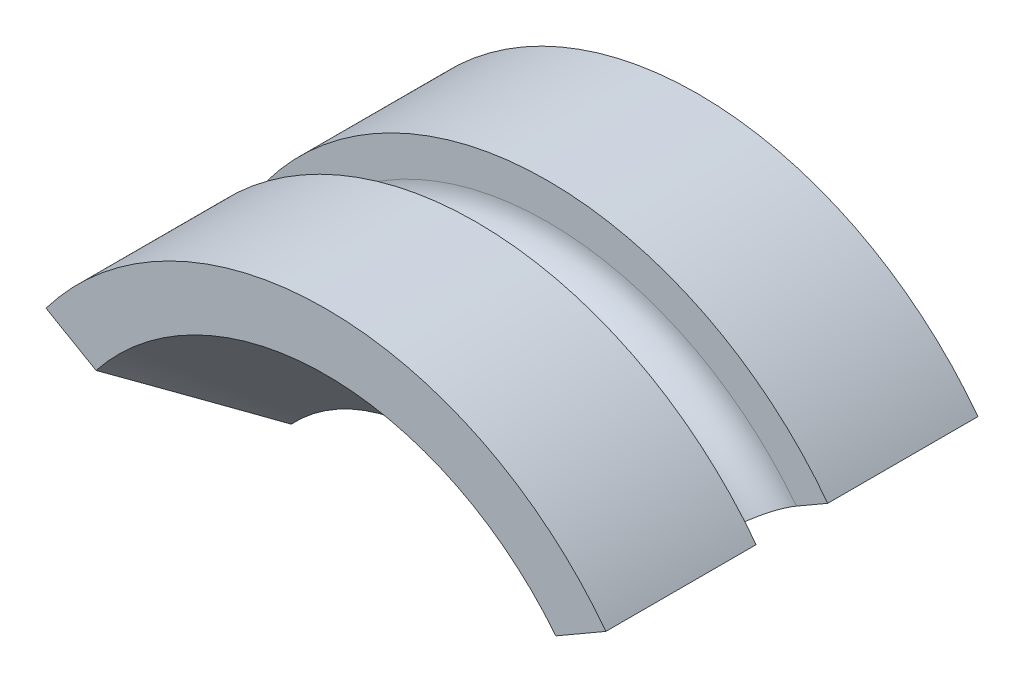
ISO-10303-21;
HEADER;
FILE_DESCRIPTION(('STEP AP214'),'2;1');
FILE_NAME('part.step','',(''),(''),'','','');
FILE_SCHEMA(('AUTOMOTIVE_DESIGN { 1 0 10303 214 1 1 1 1 }'));
ENDSEC;
DATA;
#1=APPLICATION_CONTEXT('core data for automotive mechanical design processes');
#2=APPLICATION_PROTOCOL_DEFINITION('international standard','automotive_design',2000,#1);
#3=PRODUCT_CONTEXT('',#1,'mechanical');
#4=PRODUCT('Part','Part','',(#3));
#5=PRODUCT_RELATED_PRODUCT_CATEGORY('part','',(#4));
#6=PRODUCT_DEFINITION_FORMATION('','',#4);
#7=PRODUCT_DEFINITION_CONTEXT('part definition',#1,'design');
#8=PRODUCT_DEFINITION('design','',#6,#7);
#9=PRODUCT_DEFINITION_SHAPE('','',#8);
#10=(LENGTH_UNIT() NAMED_UNIT(*) SI_UNIT(.MILLI.,.METRE.));
#11=(NAMED_UNIT(*) PLANE_ANGLE_UNIT() SI_UNIT($,.RADIAN.));
#12=(NAMED_UNIT(*) SI_UNIT($,.STERADIAN.) SOLID_ANGLE_UNIT());
#13=UNCERTAINTY_MEASURE_WITH_UNIT(LENGTH_MEASURE(1.E-05),#10,'distance_accuracy_value','');
#14=(GEOMETRIC_REPRESENTATION_CONTEXT(3) GLOBAL_UNCERTAINTY_ASSIGNED_CONTEXT((#13)) GLOBAL_UNIT_ASSIGNED_CONTEXT((#10,
#11,#12)) REPRESENTATION_CONTEXT('',''));
#15=CARTESIAN_POINT('',(0.,0.,0.));
#16=DIRECTION('',(0.,0.,1.));
#17=DIRECTION('',(1.,0.,0.));
#18=AXIS2_PLACEMENT_3D('',#15,#16,#17);
#19=CARTESIAN_POINT('',(0.,0.,0.));
#20=DIRECTION('',(0.,0.,-1.));
#21=DIRECTION('',(0.,1.,0.));
#22=AXIS2_PLACEMENT_3D('',#19,#20,#21);
#23=CYLINDRICAL_SURFACE('',#22,4.9);
#24=CARTESIAN_POINT('',(0.,0.,3.1));
#25=DIRECTION('',(0.,0.,-1.));
#26=DIRECTION('',(0.,1.,0.));
#27=AXIS2_PLACEMENT_3D('',#24,#25,#26);
#28=CIRCLE('',#27,4.9);
#29=CARTESIAN_POINT('',(-3.9115911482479,2.95117852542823,3.1));
#30=VERTEX_POINT('',#29);
#31=CARTESIAN_POINT('',(3.9115911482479,2.95117852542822,3.1));
#32=VERTEX_POINT('',#31);
#33=EDGE_CURVE('E109',#30,#32,#28,.T.);
#34=ORIENTED_EDGE('',*,*,#33,.F.);
#35=DIRECTION('',(0.,0.,-1.));
#36=VECTOR('',#35,1.);
#37=CARTESIAN_POINT('',(-3.9115911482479,2.95117852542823,5.2));
#38=LINE('',#37,#36);
#39=CARTESIAN_POINT('',(-3.9115911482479,2.95117852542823,5.2));
#40=VERTEX_POINT('',#39);
#41=EDGE_CURVE('E92',#40,#30,#38,.T.);
#42=ORIENTED_EDGE('',*,*,#41,.F.);
#43=CARTESIAN_POINT('',(0.,0.,5.2));
#44=DIRECTION('',(0.,0.,-1.));
#45=DIRECTION('',(0.,1.,0.));
#46=AXIS2_PLACEMENT_3D('',#43,#44,#45);
#47=CIRCLE('',#46,4.9);
#48=CARTESIAN_POINT('',(3.9115911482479,2.95117852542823,5.2));
#49=VERTEX_POINT('',#48);
#50=EDGE_CURVE('E107',#40,#49,#47,.T.);
#51=ORIENTED_EDGE('',*,*,#50,.T.);
#52=DIRECTION('',(0.,0.,-1.));
#53=VECTOR('',#52,1.);
#54=CARTESIAN_POINT('',(3.9115911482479,2.95117852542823,5.2));
#55=LINE('',#54,#53);
#56=EDGE_CURVE('E248',#49,#32,#55,.T.);
#57=ORIENTED_EDGE('',*,*,#56,.T.);
#58=EDGE_LOOP('',(#34,#42,#51,#57));
#59=FACE_BOUND('',#58,.T.);
#60=ADVANCED_FACE('F14',(#59),#23,.T.);
#61=CARTESIAN_POINT('',(0.,0.,5.2));
#62=DIRECTION('',(0.,0.,1.));
#63=DIRECTION('',(0.,-1.,0.));
#64=AXIS2_PLACEMENT_3D('',#61,#62,#63);
#65=CONICAL_SURFACE('',#64,4.1,0.785398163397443);
#66=CARTESIAN_POINT('',(0.,0.,5.2));
#67=DIRECTION('',(0.,0.,-1.));
#68=DIRECTION('',(0.,1.,0.));
#69=AXIS2_PLACEMENT_3D('',#66,#67,#68);
#70=CIRCLE('',#69,4.1);
#71=CARTESIAN_POINT('',(-3.21247775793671,2.54754522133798,5.2));
#72=VERTEX_POINT('',#71);
#73=CARTESIAN_POINT('',(3.21247775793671,2.54754522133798,5.2));
#74=VERTEX_POINT('',#73);
#75=EDGE_CURVE('E116',#72,#74,#70,.T.);
#76=ORIENTED_EDGE('',*,*,#75,.F.);
#77=CARTESIAN_POINT('',(-3.21265284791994,2.54764630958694,5.2002));
#78=CARTESIAN_POINT('',(-3.10651253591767,2.48636617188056,5.0789640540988));
#79=CARTESIAN_POINT('',(-3.00032557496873,2.42505910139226,4.95778247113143));
#80=CARTESIAN_POINT('',(-2.78781578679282,2.30236651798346,4.71557911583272));
#81=CARTESIAN_POINT('',(-2.68149296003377,2.24098100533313,4.59455734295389));
#82=CARTESIAN_POINT('',(-2.46866792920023,2.11810641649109,4.35272361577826));
#83=CARTESIAN_POINT('',(-2.36216572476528,2.05661734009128,4.23191166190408));
#84=CARTESIAN_POINT('',(-2.14889741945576,1.93348682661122,3.99059794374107));
#85=CARTESIAN_POINT('',(-2.04213131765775,1.87184538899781,3.8700961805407));
#86=CARTESIAN_POINT('',(-1.93519127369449,1.81010352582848,3.7498));
#87=B_SPLINE_CURVE_WITH_KNOTS('',3,(#77,#78,#79,#80,#81,#82,#83,#84,#85,#86),.UNSPECIFIED.,.F.,
.F.,(4,2,2,2,4),(0.,0.517177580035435,1.03435338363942,1.55153022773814,2.06870888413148),.UNSPECIFIED.);
#88=CARTESIAN_POINT('',(-1.93536909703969,1.81020619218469,3.75));
#89=VERTEX_POINT('',#88);
#90=EDGE_CURVE('E95',#72,#89,#87,.T.);
#91=ORIENTED_EDGE('',*,*,#90,.T.);
#92=CARTESIAN_POINT('',(0.,0.,3.75));
#93=DIRECTION('',(0.,0.,-1.));
#94=DIRECTION('',(0.,1.,0.));
#95=AXIS2_PLACEMENT_3D('',#92,#93,#94);
#96=CIRCLE('',#95,2.65);
#97=CARTESIAN_POINT('',(1.93536909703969,1.81020619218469,3.75));
#98=VERTEX_POINT('',#97);
#99=EDGE_CURVE('E130',#89,#98,#96,.T.);
#100=ORIENTED_EDGE('',*,*,#99,.T.);
#101=CARTESIAN_POINT('',(1.93519127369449,1.81010352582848,3.7498));
#102=CARTESIAN_POINT('',(2.04213131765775,1.87184538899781,3.8700961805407));
#103=CARTESIAN_POINT('',(2.14889741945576,1.93348682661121,3.99059794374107));
#104=CARTESIAN_POINT('',(2.36216572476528,2.05661734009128,4.23191166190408));
#105=CARTESIAN_POINT('',(2.46866792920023,2.11810641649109,4.35272361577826));
#106=CARTESIAN_POINT('',(2.68149296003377,2.24098100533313,4.5945573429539));
#107=CARTESIAN_POINT('',(2.78781578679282,2.30236651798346,4.71557911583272));
#108=CARTESIAN_POINT('',(3.00032557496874,2.42505910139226,4.95778247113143));
#109=CARTESIAN_POINT('',(3.10651253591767,2.48636617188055,5.0789640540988));
#110=CARTESIAN_POINT('',(3.21265284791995,2.54764630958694,5.2002));
#111=B_SPLINE_CURVE_WITH_KNOTS('',3,(#101,#102,#103,#104,#105,#106,#107,#108,#109,#110),
.UNSPECIFIED.,.F.,.F.,(4,2,2,2,4),(0.,0.517178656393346,1.03435550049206,1.55153130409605,
2.06870888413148),.UNSPECIFIED.);
#112=EDGE_CURVE('E181',#98,#74,#111,.T.);
#113=ORIENTED_EDGE('',*,*,#112,.T.);
#114=EDGE_LOOP('',(#76,#91,#100,#113));
#115=FACE_BOUND('',#114,.T.);
#116=ADVANCED_FACE('F16',(#115),#65,.F.);
#117=CARTESIAN_POINT('',(0.,0.,0.));
#118=DIRECTION('',(0.,0.,-1.));
#119=DIRECTION('',(0.,1.,0.));
#120=AXIS2_PLACEMENT_3D('',#117,#118,#119);
#121=CYLINDRICAL_SURFACE('',#120,2.65);
#122=ORIENTED_EDGE('',*,*,#99,.F.);
#123=DIRECTION('',(0.,0.,-1.));
#124=VECTOR('',#123,1.);
#125=CARTESIAN_POINT('',(-1.93536909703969,1.81020619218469,5.2));
#126=LINE('',#125,#124);
#127=CARTESIAN_POINT('',(-1.93536909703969,1.8102061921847,1.45));
#128=VERTEX_POINT('',#127);
#129=EDGE_CURVE('E110',#89,#128,#126,.T.);
#130=ORIENTED_EDGE('',*,*,#129,.T.);
#131=CARTESIAN_POINT('',(0.,0.,1.45000000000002));
#132=DIRECTION('',(0.,0.,-1.));
#133=DIRECTION('',(0.,1.,0.));
#134=AXIS2_PLACEMENT_3D('',#131,#132,#133);
#135=CIRCLE('',#134,2.65);
#136=CARTESIAN_POINT('',(1.93536909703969,1.8102061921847,1.45));
#137=VERTEX_POINT('',#136);
#138=EDGE_CURVE('E127',#128,#137,#135,.T.);
#139=ORIENTED_EDGE('',*,*,#138,.T.);
#140=DIRECTION('',(0.,0.,-1.));
#141=VECTOR('',#140,1.);
#142=CARTESIAN_POINT('',(1.93536909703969,1.81020619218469,5.2));
#143=LINE('',#142,#141);
#144=EDGE_CURVE('E246',#98,#137,#143,.T.);
#145=ORIENTED_EDGE('',*,*,#144,.F.);
#146=EDGE_LOOP('',(#122,#130,#139,#145));
#147=FACE_BOUND('',#146,.T.);
#148=ADVANCED_FACE('F209',(#147),#121,.F.);
#149=CARTESIAN_POINT('',(0.,0.,1.45000000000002));
#150=DIRECTION('',(0.,0.,-1.));
#151=DIRECTION('',(0.,1.,0.));
#152=AXIS2_PLACEMENT_3D('',#149,#150,#151);
#153=CONICAL_SURFACE('',#152,2.65,0.785398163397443);
#154=ORIENTED_EDGE('',*,*,#138,.F.);
#155=CARTESIAN_POINT('',(-1.93519127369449,1.81010352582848,1.4502));
#156=CARTESIAN_POINT('',(-2.04213131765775,1.8718453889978,1.3299038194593));
#157=CARTESIAN_POINT('',(-2.14889741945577,1.93348682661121,1.20940205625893));
#158=CARTESIAN_POINT('',(-2.36216572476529,2.05661734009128,0.968088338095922));
#159=CARTESIAN_POINT('',(-2.46866792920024,2.11810641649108,0.847276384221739));
#160=CARTESIAN_POINT('',(-2.68149296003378,2.24098100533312,0.605442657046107));
#161=CARTESIAN_POINT('',(-2.78781578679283,2.30236651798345,0.484420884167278));
#162=CARTESIAN_POINT('',(-3.00032557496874,2.42505910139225,0.242217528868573));
#163=CARTESIAN_POINT('',(-3.10651253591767,2.48636617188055,0.1210359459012));
#164=CARTESIAN_POINT('',(-3.21265284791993,2.54764630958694,-0.000200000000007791));
#165=B_SPLINE_CURVE_WITH_KNOTS('',3,(#155,#156,#157,#158,#159,#160,#161,#162,#163,#164),
.UNSPECIFIED.,.F.,.F.,(4,2,2,2,4),(0.,0.517178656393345,1.03435550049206,1.55153130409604,
2.06870888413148),.UNSPECIFIED.);
#166=CARTESIAN_POINT('',(-3.21247775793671,2.54754522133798,0.));
#167=VERTEX_POINT('',#166);
#168=EDGE_CURVE('E160',#128,#167,#165,.T.);
#169=ORIENTED_EDGE('',*,*,#168,.T.);
#170=CARTESIAN_POINT('',(0.,0.,0.));
#171=DIRECTION('',(0.,0.,-1.));
#172=DIRECTION('',(0.,1.,0.));
#173=AXIS2_PLACEMENT_3D('',#170,#171,#172);
#174=CIRCLE('',#173,4.1);
#175=CARTESIAN_POINT('',(3.21247775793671,2.54754522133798,0.));
#176=VERTEX_POINT('',#175);
#177=EDGE_CURVE('E119',#167,#176,#174,.T.);
#178=ORIENTED_EDGE('',*,*,#177,.T.);
#179=CARTESIAN_POINT('',(3.21265284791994,2.54764630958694,-0.000200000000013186));
#180=CARTESIAN_POINT('',(3.10651253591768,2.48636617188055,0.121035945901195));
#181=CARTESIAN_POINT('',(3.00032557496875,2.42505910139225,0.242217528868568));
#182=CARTESIAN_POINT('',(2.78781578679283,2.30236651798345,0.484420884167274));
#183=CARTESIAN_POINT('',(2.68149296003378,2.24098100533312,0.605442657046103));
#184=CARTESIAN_POINT('',(2.46866792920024,2.11810641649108,0.847276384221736));
#185=CARTESIAN_POINT('',(2.36216572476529,2.05661734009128,0.96808833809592));
#186=CARTESIAN_POINT('',(2.14889741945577,1.93348682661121,1.20940205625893));
#187=CARTESIAN_POINT('',(2.04213131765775,1.8718453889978,1.3299038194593));
#188=CARTESIAN_POINT('',(1.93519127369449,1.81010352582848,1.4502));
#189=B_SPLINE_CURVE_WITH_KNOTS('',3,(#179,#180,#181,#182,#183,#184,#185,#186,#187,#188),
.UNSPECIFIED.,.F.,.F.,(4,2,2,2,4),(0.,0.517177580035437,1.03435338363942,1.55153022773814,
2.06870888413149),.UNSPECIFIED.);
#190=EDGE_CURVE('E198',#176,#137,#189,.T.);
#191=ORIENTED_EDGE('',*,*,#190,.T.);
#192=EDGE_LOOP('',(#154,#169,#178,#191));
#193=FACE_BOUND('',#192,.T.);
#194=ADVANCED_FACE('F204',(#193),#153,.F.);
#195=CARTESIAN_POINT('',(4.1,0.,0.));
#196=DIRECTION('',(0.,0.,-1.));
#197=DIRECTION('',(0.,1.,0.));
#198=AXIS2_PLACEMENT_3D('',#195,#196,#197);
#199=PLANE('',#198);
#200=ORIENTED_EDGE('',*,*,#177,.F.);
#201=DIRECTION('',(-0.86602540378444,0.5,0.));
#202=VECTOR('',#201,1.);
#203=CARTESIAN_POINT('',(-1.93536909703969,1.81020619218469,0.));
#204=LINE('',#203,#202);
#205=CARTESIAN_POINT('',(-3.9115911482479,2.95117852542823,0.));
#206=VERTEX_POINT('',#205);
#207=EDGE_CURVE('E240',#167,#206,#204,.T.);
#208=ORIENTED_EDGE('',*,*,#207,.T.);
#209=CARTESIAN_POINT('',(0.,0.,0.));
#210=DIRECTION('',(0.,0.,-1.));
#211=DIRECTION('',(0.,1.,0.));
#212=AXIS2_PLACEMENT_3D('',#209,#210,#211);
#213=CIRCLE('',#212,4.9);
#214=CARTESIAN_POINT('',(3.9115911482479,2.95117852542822,0.));
#215=VERTEX_POINT('',#214);
#216=EDGE_CURVE('E115',#206,#215,#213,.T.);
#217=ORIENTED_EDGE('',*,*,#216,.T.);
#218=DIRECTION('',(-0.86602540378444,-0.5,0.));
#219=VECTOR('',#218,1.);
#220=CARTESIAN_POINT('',(1.93536909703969,1.81020619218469,0.));
#221=LINE('',#220,#219);
#222=EDGE_CURVE('E101',#215,#176,#221,.T.);
#223=ORIENTED_EDGE('',*,*,#222,.T.);
#224=EDGE_LOOP('',(#200,#208,#217,#223));
#225=FACE_BOUND('',#224,.T.);
#226=ADVANCED_FACE('F208',(#225),#199,.T.);
#227=ORIENTED_EDGE('',*,*,#216,.F.);
#228=CARTESIAN_POINT('',(-3.9115911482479,2.95117852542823,2.1));
#229=VERTEX_POINT('',#228);
#230=EDGE_CURVE('E111',#229,#206,#38,.T.);
#231=ORIENTED_EDGE('',*,*,#230,.F.);
#232=CARTESIAN_POINT('',(0.,0.,2.1));
#233=DIRECTION('',(0.,0.,-1.));
#234=DIRECTION('',(0.,1.,0.));
#235=AXIS2_PLACEMENT_3D('',#232,#233,#234);
#236=CIRCLE('',#235,4.9);
#237=CARTESIAN_POINT('',(3.9115911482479,2.95117852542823,2.1));
#238=VERTEX_POINT('',#237);
#239=EDGE_CURVE('E149',#229,#238,#236,.T.);
#240=ORIENTED_EDGE('',*,*,#239,.T.);
#241=EDGE_CURVE('E37',#238,#215,#55,.T.);
#242=ORIENTED_EDGE('',*,*,#241,.T.);
#243=EDGE_LOOP('',(#227,#231,#240,#242));
#244=FACE_BOUND('',#243,.T.);
#245=ADVANCED_FACE('F223',(#244),#23,.T.);
#246=CARTESIAN_POINT('',(4.9,0.,5.2));
#247=DIRECTION('',(0.,0.,1.));
#248=DIRECTION('',(0.,-1.,0.));
#249=AXIS2_PLACEMENT_3D('',#246,#247,#248);
#250=PLANE('',#249);
#251=ORIENTED_EDGE('',*,*,#50,.F.);
#252=DIRECTION('',(-0.86602540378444,0.5,0.));
#253=VECTOR('',#252,1.);
#254=CARTESIAN_POINT('',(-1.93536909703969,1.81020619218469,5.2));
#255=LINE('',#254,#253);
#256=EDGE_CURVE('E89',#72,#40,#255,.T.);
#257=ORIENTED_EDGE('',*,*,#256,.F.);
#258=ORIENTED_EDGE('',*,*,#75,.T.);
#259=DIRECTION('',(-0.86602540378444,-0.5,0.));
#260=VECTOR('',#259,1.);
#261=CARTESIAN_POINT('',(1.93536909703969,1.81020619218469,5.2));
#262=LINE('',#261,#260);
#263=EDGE_CURVE('E100',#49,#74,#262,.T.);
#264=ORIENTED_EDGE('',*,*,#263,.F.);
#265=EDGE_LOOP('',(#251,#257,#258,#264));
#266=FACE_BOUND('',#265,.T.);
#267=ADVANCED_FACE('F114',(#266),#250,.T.);
#268=CARTESIAN_POINT('',(4.9,0.,3.1));
#269=DIRECTION('',(0.,0.,1.));
#270=DIRECTION('',(0.,-1.,0.));
#271=AXIS2_PLACEMENT_3D('',#268,#269,#270);
#272=PLANE('',#271);
#273=DIRECTION('',(0.86602540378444,-0.5,0.));
#274=VECTOR('',#273,1.);
#275=CARTESIAN_POINT('',(3.975,-1.60214699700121,3.1));
#276=LINE('',#275,#274);
#277=CARTESIAN_POINT('',(-3.47491721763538,2.69906471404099,3.10000000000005));
#278=VERTEX_POINT('',#277);
#279=EDGE_CURVE('E180',#30,#278,#276,.T.);
#280=ORIENTED_EDGE('',*,*,#279,.F.);
#281=ORIENTED_EDGE('',*,*,#33,.T.);
#282=DIRECTION('',(0.86602540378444,0.5,0.));
#283=VECTOR('',#282,1.);
#284=CARTESIAN_POINT('',(3.375,2.64137748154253,3.1));
#285=LINE('',#284,#283);
#286=CARTESIAN_POINT('',(3.47491721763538,2.69906471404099,3.1));
#287=VERTEX_POINT('',#286);
#288=EDGE_CURVE('E146',#287,#32,#285,.T.);
#289=ORIENTED_EDGE('',*,*,#288,.F.);
#290=CARTESIAN_POINT('',(0.,0.,3.1));
#291=DIRECTION('',(0.,0.,-1.));
#292=DIRECTION('',(0.,1.,0.));
#293=AXIS2_PLACEMENT_3D('',#290,#291,#292);
#294=CIRCLE('',#293,4.4);
#295=EDGE_CURVE('E121',#278,#287,#294,.T.);
#296=ORIENTED_EDGE('',*,*,#295,.F.);
#297=EDGE_LOOP('',(#280,#281,#289,#296));
#298=FACE_BOUND('',#297,.T.);
#299=ADVANCED_FACE('F190',(#298),#272,.F.);
#300=CARTESIAN_POINT('',(0.,0.,2.6));
#301=DIRECTION('',(0.,0.,-1.));
#302=DIRECTION('',(0.,1.,0.));
#303=AXIS2_PLACEMENT_3D('',#300,#301,#302);
#304=TOROIDAL_SURFACE('',#303,4.4,0.5);
#305=CARTESIAN_POINT('',(-3.69338674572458,2.82519815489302,2.16700904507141));
#306=CARTESIAN_POINT('',(-3.71457106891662,2.83742892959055,2.18101805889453));
#307=CARTESIAN_POINT('',(-3.73475186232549,2.84908031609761,2.19708971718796));
#308=CARTESIAN_POINT('',(-3.77251220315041,2.87088125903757,2.23292352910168));
#309=CARTESIAN_POINT('',(-3.79008883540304,2.88102913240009,2.25268976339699));
#310=CARTESIAN_POINT('',(-3.82211054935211,2.89951687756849,2.29535536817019));
#311=CARTESIAN_POINT('',(-3.83655607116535,2.90785700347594,2.31825429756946));
#312=CARTESIAN_POINT('',(-3.86188697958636,2.92248181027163,2.36653496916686));
#313=CARTESIAN_POINT('',(-3.87277324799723,2.92876700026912,2.39191609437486));
#314=CARTESIAN_POINT('',(-3.8906185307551,2.93906997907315,2.44429919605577));
#315=CARTESIAN_POINT('',(-3.89759835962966,2.94309978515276,2.47129171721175));
#316=CARTESIAN_POINT('',(-3.90751314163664,2.94882408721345,2.52625054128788));
#317=CARTESIAN_POINT('',(-3.91044807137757,2.95051856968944,2.55421684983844));
#318=CARTESIAN_POINT('',(-3.9121811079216,2.95151913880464,2.61018296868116));
#319=CARTESIAN_POINT('',(-3.91099928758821,2.95083681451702,2.63818195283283));
#320=CARTESIAN_POINT('',(-3.90457839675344,2.94712971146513,2.69355214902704));
#321=CARTESIAN_POINT('',(-3.89933937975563,2.94410496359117,2.7209233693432));
#322=CARTESIAN_POINT('',(-3.88496344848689,2.93580501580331,2.77424503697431));
#323=CARTESIAN_POINT('',(-3.87582905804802,2.93053127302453,2.80019639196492));
#324=CARTESIAN_POINT('',(-3.8539302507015,2.91788799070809,2.84996896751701));
#325=CARTESIAN_POINT('',(-3.84116579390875,2.91051842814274,2.87379016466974));
#326=CARTESIAN_POINT('',(-3.81232304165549,2.89386605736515,2.91872492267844));
#327=CARTESIAN_POINT('',(-3.79623260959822,2.8845762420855,2.93982809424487));
#328=CARTESIAN_POINT('',(-3.76123096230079,2.86436803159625,2.97864215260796));
#329=CARTESIAN_POINT('',(-3.74231965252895,2.85344958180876,2.99635292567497));
#330=CARTESIAN_POINT('',(-3.70207337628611,2.83021338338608,3.02801362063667));
#331=CARTESIAN_POINT('',(-3.6807224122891,2.81788639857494,3.04193642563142));
#332=CARTESIAN_POINT('',(-3.63631128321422,2.79224562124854,3.06548315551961));
#333=CARTESIAN_POINT('',(-3.61325104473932,2.77893178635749,3.07510689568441));
#334=CARTESIAN_POINT('',(-3.5658780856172,2.75158099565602,3.08986172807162));
#335=CARTESIAN_POINT('',(-3.54155680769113,2.73753909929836,3.09495619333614));
#336=CARTESIAN_POINT('',(-3.49251890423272,2.70922705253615,3.10038893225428));
#337=CARTESIAN_POINT('',(-3.46780226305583,2.69495689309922,3.10072701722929));
#338=CARTESIAN_POINT('',(-3.4185176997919,2.6665024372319,3.09663053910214));
#339=CARTESIAN_POINT('',(-3.39395156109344,2.65231917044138,3.09216731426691));
#340=CARTESIAN_POINT('',(-3.34581476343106,2.62452737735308,3.07854719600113));
#341=CARTESIAN_POINT('',(-3.32224412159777,2.61091886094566,3.06939022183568));
#342=CARTESIAN_POINT('',(-3.2767483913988,2.58465188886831,3.04662153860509));
#343=CARTESIAN_POINT('',(-3.25482488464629,2.57199434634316,3.03300561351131));
#344=CARTESIAN_POINT('',(-3.21328312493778,2.54801020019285,3.00169432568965));
#345=CARTESIAN_POINT('',(-3.1936648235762,2.53668356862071,2.98399904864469));
#346=CARTESIAN_POINT('',(-3.15741489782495,2.51575466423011,2.9451298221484));
#347=CARTESIAN_POINT('',(-3.14076711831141,2.50614306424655,2.92397596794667));
#348=CARTESIAN_POINT('',(-3.11082240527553,2.48885447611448,2.87871192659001));
#349=CARTESIAN_POINT('',(-3.09752527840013,2.48117737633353,2.85460191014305));
#350=CARTESIAN_POINT('',(-3.07480884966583,2.46806204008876,2.80437845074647));
#351=CARTESIAN_POINT('',(-3.06535052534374,2.4626012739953,2.77828854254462));
#352=CARTESIAN_POINT('',(-3.05040538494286,2.45397269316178,2.72463383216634));
#353=CARTESIAN_POINT('',(-3.04491831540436,2.45080473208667,2.69706912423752));
#354=CARTESIAN_POINT('',(-3.03812112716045,2.44688037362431,2.64154526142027));
#355=CARTESIAN_POINT('',(-3.03676950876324,2.44610001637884,2.61359287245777));
#356=CARTESIAN_POINT('',(-3.03816719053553,2.44690696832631,2.55782574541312));
#357=CARTESIAN_POINT('',(-3.04091635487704,2.44849419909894,2.53001100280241));
#358=CARTESIAN_POINT('',(-3.05041194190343,2.45397647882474,2.47542005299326));
#359=CARTESIAN_POINT('',(-3.05714283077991,2.45786255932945,2.44864023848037));
#360=CARTESIAN_POINT('',(-3.07438520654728,2.46781744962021,2.39675653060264));
#361=CARTESIAN_POINT('',(-3.0848967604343,2.47388629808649,2.37165266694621));
#362=CARTESIAN_POINT('',(-3.10944491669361,2.48805918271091,2.32370310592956));
#363=CARTESIAN_POINT('',(-3.1234975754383,2.49617248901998,2.30086837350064));
#364=CARTESIAN_POINT('',(-3.15469214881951,2.51418268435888,2.25821171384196));
#365=CARTESIAN_POINT('',(-3.17183422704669,2.52407966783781,2.23838994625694));
#366=CARTESIAN_POINT('',(-3.20890835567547,2.54548442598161,2.2021034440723));
#367=CARTESIAN_POINT('',(-3.22886727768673,2.55700771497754,2.18567531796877));
#368=CARTESIAN_POINT('',(-3.27087014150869,2.58125807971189,2.15687588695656));
#369=CARTESIAN_POINT('',(-3.29291412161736,2.59398517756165,2.14450465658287));
#370=CARTESIAN_POINT('',(-3.33870144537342,2.62042050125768,2.12404411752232));
#371=CARTESIAN_POINT('',(-3.36245967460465,2.63413732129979,2.11599921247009));
#372=CARTESIAN_POINT('',(-3.41081254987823,2.66205386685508,2.10460023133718));
#373=CARTESIAN_POINT('',(-3.4354074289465,2.67625372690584,2.10124747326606));
#374=CARTESIAN_POINT('',(-3.48487731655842,2.70481517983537,2.09932393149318));
#375=CARTESIAN_POINT('',(-3.50975312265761,2.71917723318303,2.10078078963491));
#376=CARTESIAN_POINT('',(-3.55891792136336,2.74756254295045,2.10850467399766));
#377=CARTESIAN_POINT('',(-3.58320757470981,2.76158618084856,2.11476599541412));
#378=CARTESIAN_POINT('',(-3.6219024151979,2.7839266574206,2.12879169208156));
#379=CARTESIAN_POINT('',(-3.63669172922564,2.79246527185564,2.13518282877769));
#380=CARTESIAN_POINT('',(-3.66558929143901,2.80914928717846,2.14976522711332));
#381=CARTESIAN_POINT('',(-3.67969753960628,2.81729468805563,2.15795648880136));
#382=CARTESIAN_POINT('',(-3.69338674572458,2.82519815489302,2.16700904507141));
#383=B_SPLINE_CURVE_WITH_KNOTS('',3,(#305,#306,#307,#308,#309,#310,#311,#312,#313,#314,#315,
#316,#317,#318,#319,#320,#321,#322,#323,#324,#325,#326,#327,#328,#329,#330,#331,#332,#333,#334,
#335,#336,#337,#338,#339,#340,#341,#342,#343,#344,#345,#346,#347,#348,#349,#350,#351,#352,#353,
#354,#355,#356,#357,#358,#359,#360,#361,#362,#363,#364,#365,#366,#367,#368,#369,#370,#371,#372,
#373,#374,#375,#376,#377,#378,#379,#380,#381,#382),.UNSPECIFIED.,.T.,.F.,(4,2,2,2,2,2,2,2,2,2,2,
2,2,2,2,2,2,2,2,2,2,2,2,2,2,2,2,2,2,2,2,2,2,2,2,2,2,2,4),(0.,0.0845012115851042,
0.169096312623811,0.253679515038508,0.338241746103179,0.422349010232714,0.506456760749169,
0.590154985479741,0.673852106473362,0.757495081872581,0.841138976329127,0.925093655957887,
1.00905114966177,1.09359473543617,1.1781419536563,1.26336682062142,1.34859506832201,
1.43433492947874,1.5200762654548,1.60589890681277,1.69171974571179,1.77705859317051,
1.86239251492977,1.94683585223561,2.03127379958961,2.11486157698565,2.19844658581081,
2.28170763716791,2.36497016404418,2.44861724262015,2.53226875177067,2.61678027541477,
2.70129335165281,2.78665803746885,2.8720466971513,2.95792695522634,3.04370539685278,
3.0983096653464,3.15291393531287),.UNSPECIFIED.);
#384=CARTESIAN_POINT('',(-3.47491721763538,2.69906471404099,2.1));
#385=VERTEX_POINT('',#384);
#386=EDGE_CURVE('E29',#278,#385,#383,.T.);
#387=ORIENTED_EDGE('',*,*,#386,.F.);
#388=ORIENTED_EDGE('',*,*,#295,.T.);
#389=CARTESIAN_POINT('',(3.04227121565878,2.44927642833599,2.52482086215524));
#390=CARTESIAN_POINT('',(3.0386112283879,2.44716333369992,2.55228730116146));
#391=CARTESIAN_POINT('',(3.03695863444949,2.4462092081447,2.58013056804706));
#392=CARTESIAN_POINT('',(3.03773071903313,2.4466549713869,2.63576372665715));
#393=CARTESIAN_POINT('',(3.04016013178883,2.44805759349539,2.66355351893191));
#394=CARTESIAN_POINT('',(3.04902482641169,2.45317562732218,2.71825238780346));
#395=CARTESIAN_POINT('',(3.05545769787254,2.45688964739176,2.74516198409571));
#396=CARTESIAN_POINT('',(3.07213036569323,2.46651561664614,2.79735108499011));
#397=CARTESIAN_POINT('',(3.08236932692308,2.47242708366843,2.82263094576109));
#398=CARTESIAN_POINT('',(3.10639021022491,2.48629554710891,2.87095161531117));
#399=CARTESIAN_POINT('',(3.12018418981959,2.49425950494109,2.89398442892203));
#400=CARTESIAN_POINT('',(3.15089429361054,2.51198999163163,2.93708437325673));
#401=CARTESIAN_POINT('',(3.16781067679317,2.52175667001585,2.9571512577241));
#402=CARTESIAN_POINT('',(3.20446700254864,2.54292020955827,2.99396729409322));
#403=CARTESIAN_POINT('',(3.22423382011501,2.55433258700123,3.01068076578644));
#404=CARTESIAN_POINT('',(3.26589669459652,2.57838665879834,3.04008486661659));
#405=CARTESIAN_POINT('',(3.28779287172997,2.59102842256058,3.05277526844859));
#406=CARTESIAN_POINT('',(3.33333587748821,2.6173226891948,3.07390442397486));
#407=CARTESIAN_POINT('',(3.35699840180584,2.63098425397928,3.08229808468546));
#408=CARTESIAN_POINT('',(3.40520496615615,2.65881632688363,3.09440766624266));
#409=CARTESIAN_POINT('',(3.42974903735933,2.67298685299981,3.09812342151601));
#410=CARTESIAN_POINT('',(3.47916688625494,2.70151826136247,3.10078064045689));
#411=CARTESIAN_POINT('',(3.50404173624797,2.71587976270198,3.09969562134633));
#412=CARTESIAN_POINT('',(3.55328033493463,2.74430768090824,3.0927144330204));
#413=CARTESIAN_POINT('',(3.5776440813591,2.75837409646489,3.08681824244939));
#414=CARTESIAN_POINT('',(3.62514023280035,2.78579601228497,3.07037784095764));
#415=CARTESIAN_POINT('',(3.64827382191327,2.79915219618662,3.05983819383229));
#416=CARTESIAN_POINT('',(3.69266678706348,2.82478248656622,3.03439719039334));
#417=CARTESIAN_POINT('',(3.71392621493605,2.83705662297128,3.0194959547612));
#418=CARTESIAN_POINT('',(3.75382687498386,2.86009327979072,2.98584745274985));
#419=CARTESIAN_POINT('',(3.7724832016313,2.8708645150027,2.96712405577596));
#420=CARTESIAN_POINT('',(3.8067812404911,2.89066649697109,2.92629984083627));
#421=CARTESIAN_POINT('',(3.82242308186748,2.89969731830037,2.90419916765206));
#422=CARTESIAN_POINT('',(3.85011427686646,2.91568483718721,2.85743932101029));
#423=CARTESIAN_POINT('',(3.86219160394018,2.92265768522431,2.83280223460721));
#424=CARTESIAN_POINT('',(3.88256383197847,2.93441959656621,2.78152436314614));
#425=CARTESIAN_POINT('',(3.89085888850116,2.93920874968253,2.75488366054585));
#426=CARTESIAN_POINT('',(3.90337499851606,2.94643492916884,2.70055358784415));
#427=CARTESIAN_POINT('',(3.907623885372,2.94888802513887,2.67287276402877));
#428=CARTESIAN_POINT('',(3.91202090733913,2.95142664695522,2.61708043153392));
#429=CARTESIAN_POINT('',(3.91216914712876,2.95151223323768,2.58896893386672));
#430=CARTESIAN_POINT('',(3.90836744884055,2.9493173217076,2.53321842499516));
#431=CARTESIAN_POINT('',(3.9044319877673,2.94704518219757,2.50557809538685));
#432=CARTESIAN_POINT('',(3.89260142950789,2.94021480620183,2.45145185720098));
#433=CARTESIAN_POINT('',(3.88470634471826,2.93565657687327,2.42496594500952));
#434=CARTESIAN_POINT('',(3.86517965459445,2.92438283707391,2.37387211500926));
#435=CARTESIAN_POINT('',(3.85354479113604,2.9176654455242,2.34926585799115));
#436=CARTESIAN_POINT('',(3.82687949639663,2.90227023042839,2.30264337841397));
#437=CARTESIAN_POINT('',(3.81184899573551,2.89359236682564,2.2806272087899));
#438=CARTESIAN_POINT('',(3.77874217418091,2.87447813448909,2.23968838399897));
#439=CARTESIAN_POINT('',(3.76065099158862,2.86403318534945,2.22078175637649));
#440=CARTESIAN_POINT('',(3.72199447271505,2.84171483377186,2.18671228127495));
#441=CARTESIAN_POINT('',(3.70142904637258,2.82984137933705,2.17154957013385));
#442=CARTESIAN_POINT('',(3.65824062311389,2.80490653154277,2.14527402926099));
#443=CARTESIAN_POINT('',(3.6356031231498,2.79183676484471,2.13419298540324));
#444=CARTESIAN_POINT('',(3.58904616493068,2.76495709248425,2.11653872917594));
#445=CARTESIAN_POINT('',(3.56512664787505,2.75114715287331,2.10996572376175));
#446=CARTESIAN_POINT('',(3.51648765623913,2.7230654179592,2.10146522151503));
#447=CARTESIAN_POINT('',(3.49176344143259,2.70879088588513,2.0995738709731));
#448=CARTESIAN_POINT('',(3.44238848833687,2.68028424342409,2.10058704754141));
#449=CARTESIAN_POINT('',(3.41773775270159,2.66605213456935,2.10349174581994));
#450=CARTESIAN_POINT('',(3.36909019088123,2.63796545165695,2.11403947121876));
#451=CARTESIAN_POINT('',(3.34509690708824,2.62411292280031,2.121704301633));
#452=CARTESIAN_POINT('',(3.29856760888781,2.59724921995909,2.14158135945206));
#453=CARTESIAN_POINT('',(3.27603154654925,2.58423801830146,2.15379343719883));
#454=CARTESIAN_POINT('',(3.23309352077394,2.55944773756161,2.18241161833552));
#455=CARTESIAN_POINT('',(3.21268873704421,2.54766703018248,2.19881207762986));
#456=CARTESIAN_POINT('',(3.17457104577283,2.52565977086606,2.23536892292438));
#457=CARTESIAN_POINT('',(3.15685871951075,2.51543355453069,2.2555261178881));
#458=CARTESIAN_POINT('',(3.12477845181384,2.49691200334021,2.29886899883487));
#459=CARTESIAN_POINT('',(3.11038749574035,2.48860338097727,2.32203199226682));
#460=CARTESIAN_POINT('',(3.08523735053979,2.47408293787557,2.37082643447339));
#461=CARTESIAN_POINT('',(3.07447350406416,2.46786842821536,2.39645466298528));
#462=CARTESIAN_POINT('',(3.06022911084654,2.45964442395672,2.43937612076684));
#463=CARTESIAN_POINT('',(3.05553440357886,2.45693393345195,2.45614603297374));
#464=CARTESIAN_POINT('',(3.04771492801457,2.45241935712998,2.49016716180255));
#465=CARTESIAN_POINT('',(3.04459015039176,2.45061526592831,2.50741837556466));
#466=CARTESIAN_POINT('',(3.04227121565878,2.44927642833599,2.52482086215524));
#467=B_SPLINE_CURVE_WITH_KNOTS('',3,(#389,#390,#391,#392,#393,#394,#395,#396,#397,#398,#399,
#400,#401,#402,#403,#404,#405,#406,#407,#408,#409,#410,#411,#412,#413,#414,#415,#416,#417,#418,
#419,#420,#421,#422,#423,#424,#425,#426,#427,#428,#429,#430,#431,#432,#433,#434,#435,#436,#437,
#438,#439,#440,#441,#442,#443,#444,#445,#446,#447,#448,#449,#450,#451,#452,#453,#454,#455,#456,
#457,#458,#459,#460,#461,#462,#463,#464,#465,#466),.UNSPECIFIED.,.T.,.F.,(4,2,2,2,2,2,2,2,2,2,2,
2,2,2,2,2,2,2,2,2,2,2,2,2,2,2,2,2,2,2,2,2,2,2,2,2,2,2,4),(0.,0.0833046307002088,
0.166705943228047,0.250057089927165,0.333389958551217,0.417009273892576,0.500635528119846,
0.585109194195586,0.669587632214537,0.754935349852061,0.840286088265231,0.926108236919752,
1.0119307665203,1.09766913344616,1.18340512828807,1.2686212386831,1.35383369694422,
1.43835847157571,1.52287976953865,1.60681535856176,1.69074880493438,1.77438571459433,
1.85802236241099,1.94173207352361,2.02544349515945,2.1095737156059,2.19370699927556,
2.27848227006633,2.36326143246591,2.44869314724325,2.53412791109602,2.61995691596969,
2.70578309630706,2.79149422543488,2.87722383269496,2.96234025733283,3.04734696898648,
3.10012834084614,3.1529093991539),.UNSPECIFIED.);
#468=CARTESIAN_POINT('',(3.47491721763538,2.69906471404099,2.1));
#469=VERTEX_POINT('',#468);
#470=EDGE_CURVE('E134',#469,#287,#467,.T.);
#471=ORIENTED_EDGE('',*,*,#470,.F.);
#472=CARTESIAN_POINT('',(0.,0.,2.1));
#473=DIRECTION('',(0.,0.,-1.));
#474=DIRECTION('',(0.,1.,0.));
#475=AXIS2_PLACEMENT_3D('',#472,#473,#474);
#476=CIRCLE('',#475,4.4);
#477=EDGE_CURVE('E144',#385,#469,#476,.T.);
#478=ORIENTED_EDGE('',*,*,#477,.F.);
#479=EDGE_LOOP('',(#387,#388,#471,#478));
#480=FACE_BOUND('',#479,.T.);
#481=ADVANCED_FACE('F143',(#480),#304,.F.);
#482=CARTESIAN_POINT('',(4.9,0.,2.1));
#483=DIRECTION('',(0.,0.,-1.));
#484=DIRECTION('',(0.,1.,0.));
#485=AXIS2_PLACEMENT_3D('',#482,#483,#484);
#486=PLANE('',#485);
#487=DIRECTION('',(-0.86602540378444,0.5,0.));
#488=VECTOR('',#487,1.);
#489=CARTESIAN_POINT('',(3.975,-1.6021469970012,2.1));
#490=LINE('',#489,#488);
#491=EDGE_CURVE('E9',#385,#229,#490,.T.);
#492=ORIENTED_EDGE('',*,*,#491,.F.);
#493=ORIENTED_EDGE('',*,*,#477,.T.);
#494=DIRECTION('',(-0.86602540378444,-0.5,0.));
#495=VECTOR('',#494,1.);
#496=CARTESIAN_POINT('',(3.375,2.64137748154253,2.1));
#497=LINE('',#496,#495);
#498=EDGE_CURVE('E23',#238,#469,#497,.T.);
#499=ORIENTED_EDGE('',*,*,#498,.F.);
#500=ORIENTED_EDGE('',*,*,#239,.F.);
#501=EDGE_LOOP('',(#492,#493,#499,#500));
#502=FACE_BOUND('',#501,.T.);
#503=ADVANCED_FACE('F148',(#502),#486,.F.);
#504=CARTESIAN_POINT('',(1.93536909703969,1.81020619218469,5.2));
#505=DIRECTION('',(0.5,-0.86602540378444,0.));
#506=DIRECTION('',(0.86602540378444,0.5,0.));
#507=AXIS2_PLACEMENT_3D('',#504,#505,#506);
#508=PLANE('',#507);
#509=ORIENTED_EDGE('',*,*,#144,.T.);
#510=ORIENTED_EDGE('',*,*,#190,.F.);
#511=ORIENTED_EDGE('',*,*,#222,.F.);
#512=ORIENTED_EDGE('',*,*,#241,.F.);
#513=ORIENTED_EDGE('',*,*,#498,.T.);
#514=ORIENTED_EDGE('',*,*,#470,.T.);
#515=ORIENTED_EDGE('',*,*,#288,.T.);
#516=ORIENTED_EDGE('',*,*,#56,.F.);
#517=ORIENTED_EDGE('',*,*,#263,.T.);
#518=ORIENTED_EDGE('',*,*,#112,.F.);
#519=EDGE_LOOP('',(#509,#510,#511,#512,#513,#514,#515,#516,#517,#518));
#520=FACE_BOUND('',#519,.T.);
#521=ADVANCED_FACE('F133',(#520),#508,.T.);
#522=CARTESIAN_POINT('',(-1.93536909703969,1.81020619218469,5.2));
#523=DIRECTION('',(-0.5,-0.86602540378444,0.));
#524=DIRECTION('',(0.86602540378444,-0.5,0.));
#525=AXIS2_PLACEMENT_3D('',#522,#523,#524);
#526=PLANE('',#525);
#527=ORIENTED_EDGE('',*,*,#256,.T.);
#528=ORIENTED_EDGE('',*,*,#41,.T.);
#529=ORIENTED_EDGE('',*,*,#279,.T.);
#530=ORIENTED_EDGE('',*,*,#386,.T.);
#531=ORIENTED_EDGE('',*,*,#491,.T.);
#532=ORIENTED_EDGE('',*,*,#230,.T.);
#533=ORIENTED_EDGE('',*,*,#207,.F.);
#534=ORIENTED_EDGE('',*,*,#168,.F.);
#535=ORIENTED_EDGE('',*,*,#129,.F.);
#536=ORIENTED_EDGE('',*,*,#90,.F.);
#537=EDGE_LOOP('',(#527,#528,#529,#530,#531,#532,#533,#534,#535,#536));
#538=FACE_BOUND('',#537,.T.);
#539=ADVANCED_FACE('F91',(#538),#526,.T.);
#540=CLOSED_SHELL('',(#60,#116,#148,#194,#226,#245,#267,#299,#481,#503,#521,#539));
#541=MANIFOLD_SOLID_BREP('B1',#540);
#542=ADVANCED_BREP_SHAPE_REPRESENTATION('',(#18,#541),#14);
#543=SHAPE_DEFINITION_REPRESENTATION(#9,#542);
ENDSEC;
END-ISO-10303-21;
